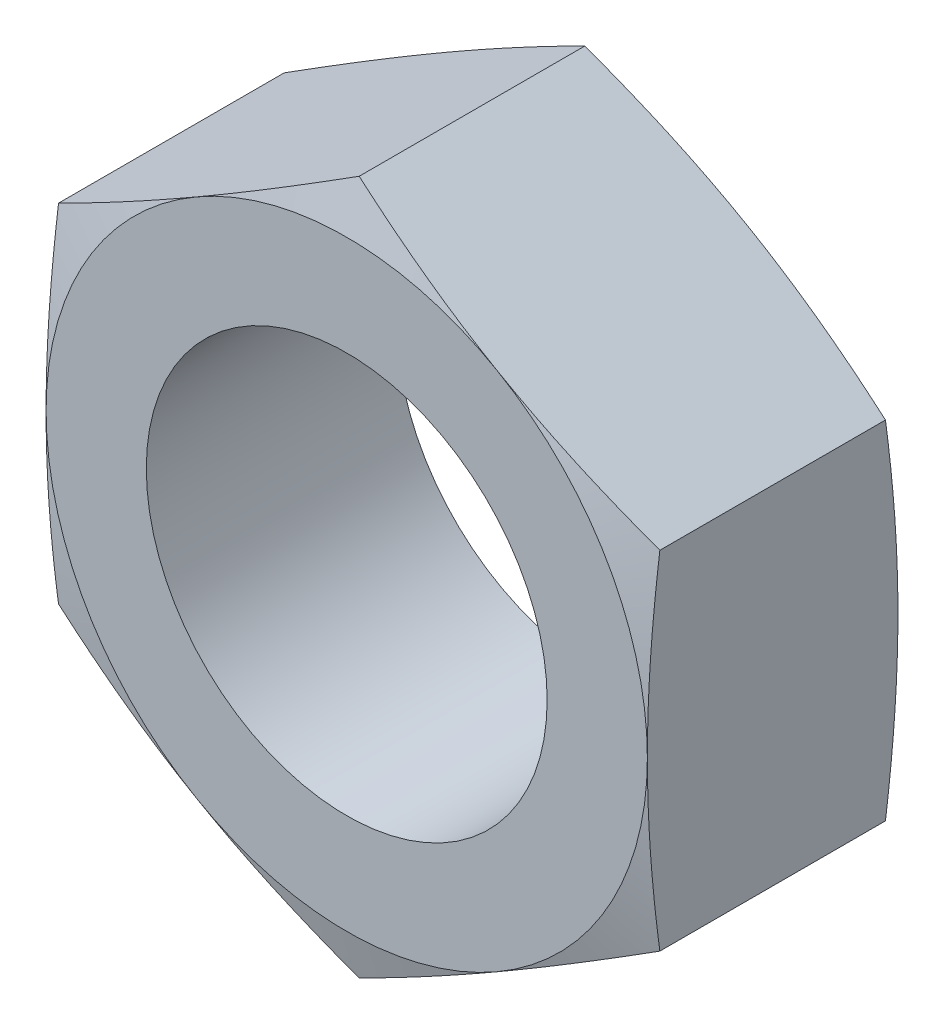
ISO-10303-21;
HEADER;
FILE_DESCRIPTION(('STEP AP214'),'2;1');
FILE_NAME('part.step','',(''),(''),'','','');
FILE_SCHEMA(('AUTOMOTIVE_DESIGN { 1 0 10303 214 1 1 1 1 }'));
ENDSEC;
DATA;
#1=APPLICATION_CONTEXT('core data for automotive mechanical design processes');
#2=APPLICATION_PROTOCOL_DEFINITION('international standard','automotive_design',2000,#1);
#3=PRODUCT_CONTEXT('',#1,'mechanical');
#4=PRODUCT('Part','Part','',(#3));
#5=PRODUCT_RELATED_PRODUCT_CATEGORY('part','',(#4));
#6=PRODUCT_DEFINITION_FORMATION('','',#4);
#7=PRODUCT_DEFINITION_CONTEXT('part definition',#1,'design');
#8=PRODUCT_DEFINITION('design','',#6,#7);
#9=PRODUCT_DEFINITION_SHAPE('','',#8);
#10=(LENGTH_UNIT() NAMED_UNIT(*) SI_UNIT(.MILLI.,.METRE.));
#11=(NAMED_UNIT(*) PLANE_ANGLE_UNIT() SI_UNIT($,.RADIAN.));
#12=(NAMED_UNIT(*) SI_UNIT($,.STERADIAN.) SOLID_ANGLE_UNIT());
#13=UNCERTAINTY_MEASURE_WITH_UNIT(LENGTH_MEASURE(1.E-05),#10,'distance_accuracy_value','');
#14=(GEOMETRIC_REPRESENTATION_CONTEXT(3) GLOBAL_UNCERTAINTY_ASSIGNED_CONTEXT((#13)) GLOBAL_UNIT_ASSIGNED_CONTEXT((#10,
#11,#12)) REPRESENTATION_CONTEXT('',''));
#15=CARTESIAN_POINT('',(0.,0.,0.));
#16=DIRECTION('',(0.,0.,1.));
#17=DIRECTION('',(1.,0.,0.));
#18=AXIS2_PLACEMENT_3D('',#15,#16,#17);
#19=CARTESIAN_POINT('',(0.,0.,10.));
#20=DIRECTION('',(0.,0.,1.));
#21=DIRECTION('',(1.,0.,0.));
#22=AXIS2_PLACEMENT_3D('',#19,#20,#21);
#23=PLANE('',#22);
#24=CARTESIAN_POINT('',(0.,0.,10.));
#25=DIRECTION('',(0.,0.,1.));
#26=DIRECTION('',(1.,0.,0.));
#27=AXIS2_PLACEMENT_3D('',#24,#25,#26);
#28=CIRCLE('',#27,8.);
#29=CARTESIAN_POINT('',(8.,0.,10.));
#30=VERTEX_POINT('',#29);
#31=EDGE_CURVE('E237',#30,#30,#28,.T.);
#32=ORIENTED_EDGE('',*,*,#31,.F.);
#33=EDGE_LOOP('',(#32));
#34=FACE_BOUND('',#33,.T.);
#35=CARTESIAN_POINT('',(0.,0.,10.));
#36=DIRECTION('',(0.,0.,-1.));
#37=DIRECTION('',(-1.,0.,0.));
#38=AXIS2_PLACEMENT_3D('',#35,#36,#37);
#39=CIRCLE('',#38,12.);
#40=CARTESIAN_POINT('',(12.,0.,10.));
#41=VERTEX_POINT('',#40);
#42=CARTESIAN_POINT('',(6.,-10.3923048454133,10.));
#43=VERTEX_POINT('',#42);
#44=EDGE_CURVE('E311',#41,#43,#39,.T.);
#45=ORIENTED_EDGE('',*,*,#44,.F.);
#46=CARTESIAN_POINT('',(6.,10.3923048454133,10.));
#47=VERTEX_POINT('',#46);
#48=EDGE_CURVE('E305',#47,#41,#39,.T.);
#49=ORIENTED_EDGE('',*,*,#48,.F.);
#50=CARTESIAN_POINT('',(-6.,10.3923048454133,10.));
#51=VERTEX_POINT('',#50);
#52=EDGE_CURVE('E307',#51,#47,#39,.T.);
#53=ORIENTED_EDGE('',*,*,#52,.F.);
#54=CARTESIAN_POINT('',(-12.,0.,10.));
#55=VERTEX_POINT('',#54);
#56=EDGE_CURVE('E36',#55,#51,#39,.T.);
#57=ORIENTED_EDGE('',*,*,#56,.F.);
#58=CARTESIAN_POINT('',(-6.,-10.3923048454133,10.));
#59=VERTEX_POINT('',#58);
#60=EDGE_CURVE('E44',#59,#55,#39,.T.);
#61=ORIENTED_EDGE('',*,*,#60,.F.);
#62=EDGE_CURVE('E312',#43,#59,#39,.T.);
#63=ORIENTED_EDGE('',*,*,#62,.F.);
#64=EDGE_LOOP('',(#45,#49,#53,#57,#61,#63));
#65=FACE_BOUND('',#64,.T.);
#66=ADVANCED_FACE('F14',(#34,#65),#23,.T.);
#67=CARTESIAN_POINT('',(0.,0.,0.));
#68=DIRECTION('',(0.,0.,1.));
#69=DIRECTION('',(1.,0.,0.));
#70=AXIS2_PLACEMENT_3D('',#67,#68,#69);
#71=PLANE('',#70);
#72=CARTESIAN_POINT('',(0.,0.,0.));
#73=DIRECTION('',(0.,0.,1.));
#74=DIRECTION('',(1.,0.,0.));
#75=AXIS2_PLACEMENT_3D('',#72,#73,#74);
#76=CIRCLE('',#75,8.);
#77=CARTESIAN_POINT('',(8.,0.,0.));
#78=VERTEX_POINT('',#77);
#79=EDGE_CURVE('E241',#78,#78,#76,.T.);
#80=ORIENTED_EDGE('',*,*,#79,.T.);
#81=EDGE_LOOP('',(#80));
#82=FACE_BOUND('',#81,.T.);
#83=CARTESIAN_POINT('',(0.,0.,0.));
#84=DIRECTION('',(0.,0.,-1.));
#85=DIRECTION('',(-1.,0.,0.));
#86=AXIS2_PLACEMENT_3D('',#83,#84,#85);
#87=CIRCLE('',#86,12.);
#88=CARTESIAN_POINT('',(6.,10.3923048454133,0.));
#89=VERTEX_POINT('',#88);
#90=CARTESIAN_POINT('',(12.,0.,0.));
#91=VERTEX_POINT('',#90);
#92=EDGE_CURVE('E277',#89,#91,#87,.T.);
#93=ORIENTED_EDGE('',*,*,#92,.T.);
#94=CARTESIAN_POINT('',(6.,-10.3923048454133,0.));
#95=VERTEX_POINT('',#94);
#96=EDGE_CURVE('E146',#91,#95,#87,.T.);
#97=ORIENTED_EDGE('',*,*,#96,.T.);
#98=CARTESIAN_POINT('',(-6.,-10.3923048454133,0.));
#99=VERTEX_POINT('',#98);
#100=EDGE_CURVE('E145',#95,#99,#87,.T.);
#101=ORIENTED_EDGE('',*,*,#100,.T.);
#102=CARTESIAN_POINT('',(-12.,0.,0.));
#103=VERTEX_POINT('',#102);
#104=EDGE_CURVE('E124',#99,#103,#87,.T.);
#105=ORIENTED_EDGE('',*,*,#104,.T.);
#106=CARTESIAN_POINT('',(-6.,10.3923048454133,0.));
#107=VERTEX_POINT('',#106);
#108=EDGE_CURVE('E111',#103,#107,#87,.T.);
#109=ORIENTED_EDGE('',*,*,#108,.T.);
#110=EDGE_CURVE('E122',#107,#89,#87,.T.);
#111=ORIENTED_EDGE('',*,*,#110,.T.);
#112=EDGE_LOOP('',(#93,#97,#101,#105,#109,#111));
#113=FACE_BOUND('',#112,.T.);
#114=ADVANCED_FACE('F143',(#82,#113),#71,.F.);
#115=CARTESIAN_POINT('',(0.,0.,10.));
#116=DIRECTION('',(0.,0.,-1.));
#117=DIRECTION('',(-1.,0.,0.));
#118=AXIS2_PLACEMENT_3D('',#115,#116,#117);
#119=CYLINDRICAL_SURFACE('',#118,8.);
#120=ORIENTED_EDGE('',*,*,#31,.T.);
#121=EDGE_LOOP('',(#120));
#122=FACE_BOUND('',#121,.T.);
#123=ORIENTED_EDGE('',*,*,#79,.F.);
#124=EDGE_LOOP('',(#123));
#125=FACE_BOUND('',#124,.T.);
#126=ADVANCED_FACE('F172',(#122,#125),#119,.F.);
#127=CARTESIAN_POINT('',(0.,0.,1.30075128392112));
#128=DIRECTION('',(0.,0.,1.));
#129=DIRECTION('',(1.,0.,0.));
#130=AXIS2_PLACEMENT_3D('',#127,#128,#129);
#131=CONICAL_SURFACE('',#130,16.8544698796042,1.30899693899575);
#132=CARTESIAN_POINT('',(12.,-18.3750842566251,2.66512525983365));
#133=CARTESIAN_POINT('',(12.,-17.8301342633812,2.5429004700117));
#134=CARTESIAN_POINT('',(12.,-17.2848447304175,2.42216258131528));
#135=CARTESIAN_POINT('',(12.,-16.193419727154,2.18446328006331));
#136=CARTESIAN_POINT('',(12.,-15.6472842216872,2.06750202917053));
#137=CARTESIAN_POINT('',(12.,-14.5535179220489,1.83805828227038));
#138=CARTESIAN_POINT('',(12.,-14.0058861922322,1.72558023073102));
#139=CARTESIAN_POINT('',(12.,-12.9094863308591,1.50630937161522));
#140=CARTESIAN_POINT('',(12.,-12.3607182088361,1.39951651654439));
#141=CARTESIAN_POINT('',(12.,-11.2662261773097,1.19379445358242));
#142=CARTESIAN_POINT('',(12.,-10.7205128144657,1.09480940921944));
#143=CARTESIAN_POINT('',(12.,-9.62758625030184,0.905426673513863));
#144=CARTESIAN_POINT('',(12.,-9.08037304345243,0.815029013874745));
#145=CARTESIAN_POINT('',(12.,-7.98435571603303,0.644850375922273));
#146=CARTESIAN_POINT('',(12.,-7.43555180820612,0.565068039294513));
#147=CARTESIAN_POINT('',(12.,-6.33619606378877,0.418461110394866));
#148=CARTESIAN_POINT('',(12.,-5.785644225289,0.35163653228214));
#149=CARTESIAN_POINT('',(12.,-4.6765611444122,0.232826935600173));
#150=CARTESIAN_POINT('',(12.,-4.11801054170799,0.181019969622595));
#151=CARTESIAN_POINT('',(12.,-2.99949490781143,0.0958132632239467));
#152=CARTESIAN_POINT('',(12.,-2.43952990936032,0.0624131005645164));
#153=CARTESIAN_POINT('',(12.,-1.31899926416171,0.0159674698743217));
#154=CARTESIAN_POINT('',(12.,-0.758434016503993,0.00291256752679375));
#155=CARTESIAN_POINT('',(12.,0.362791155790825,-0.00203881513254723));
#156=CARTESIAN_POINT('',(12.,0.92345108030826,0.00606467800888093));
#157=CARTESIAN_POINT('',(12.,2.04612377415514,0.042974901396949));
#158=CARTESIAN_POINT('',(12.,2.60813401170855,0.0718570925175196));
#159=CARTESIAN_POINT('',(12.,3.73083907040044,0.148671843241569));
#160=CARTESIAN_POINT('',(12.,4.29153386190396,0.196604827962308));
#161=CARTESIAN_POINT('',(12.,5.41160234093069,0.309088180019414));
#162=CARTESIAN_POINT('',(12.,5.97097491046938,0.373649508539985));
#163=CARTESIAN_POINT('',(12.,7.08791795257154,0.5166885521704));
#164=CARTESIAN_POINT('',(12.,7.64548841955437,0.595166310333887));
#165=CARTESIAN_POINT('',(12.,8.7262421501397,0.758578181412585));
#166=CARTESIAN_POINT('',(12.,9.249524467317,0.842863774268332));
#167=CARTESIAN_POINT('',(12.,10.2946969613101,1.01970382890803));
#168=CARTESIAN_POINT('',(12.,10.8165870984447,1.11225852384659));
#169=CARTESIAN_POINT('',(12.,11.8591756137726,1.30411496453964));
#170=CARTESIAN_POINT('',(12.,12.3798738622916,1.40341741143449));
#171=CARTESIAN_POINT('',(12.,13.4201836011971,1.60751548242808));
#172=CARTESIAN_POINT('',(12.,13.9397951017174,1.71231105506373));
#173=CARTESIAN_POINT('',(12.,14.9782183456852,1.92642151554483));
#174=CARTESIAN_POINT('',(12.,15.4970298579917,2.03573752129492));
#175=CARTESIAN_POINT('',(12.,16.5338600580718,2.2580722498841));
#176=CARTESIAN_POINT('',(12.,17.0518787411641,2.37109099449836));
#177=CARTESIAN_POINT('',(12.,18.6048525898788,2.71469433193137));
#178=CARTESIAN_POINT('',(12.,19.6387979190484,2.94984114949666));
#179=CARTESIAN_POINT('',(12.,21.6944963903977,3.42623171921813));
#180=CARTESIAN_POINT('',(12.,22.7162689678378,3.66739215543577));
#181=CARTESIAN_POINT('',(12.,24.7583939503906,4.15572601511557));
#182=CARTESIAN_POINT('',(12.,25.7787463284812,4.40289955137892));
#183=CARTESIAN_POINT('',(12.,27.8170752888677,4.90137714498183));
#184=CARTESIAN_POINT('',(12.,28.8350532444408,5.15267559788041));
#185=CARTESIAN_POINT('',(12.,30.361374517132,5.53214451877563));
#186=CARTESIAN_POINT('',(12.,30.8700323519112,5.6590522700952));
#187=CARTESIAN_POINT('',(12.,31.8871612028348,5.91361202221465));
#188=CARTESIAN_POINT('',(12.,32.3956322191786,6.04126402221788));
#189=CARTESIAN_POINT('',(12.,32.9040217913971,6.16923953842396));
#190=B_SPLINE_CURVE_WITH_KNOTS('',3,(#132,#133,#134,#135,#136,#137,#138,#139,#140,#141,#142,
#143,#144,#145,#146,#147,#148,#149,#150,#151,#152,#153,#154,#155,#156,#157,#158,#159,#160,#161,
#162,#163,#164,#165,#166,#167,#168,#169,#170,#171,#172,#173,#174,#175,#176,#177,#178,#179,#180,
#181,#182,#183,#184,#185,#186,#187,#188,#189),.UNSPECIFIED.,.F.,.F.,(4,2,2,2,2,2,2,2,2,2,2,2,2,
2,2,2,2,2,2,2,2,2,2,2,2,2,2,2,4),(0.,1.6754722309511,3.35101608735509,5.0281816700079,
6.70533323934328,8.36913239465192,10.0329376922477,11.6965298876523,13.3601239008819,
15.0427029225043,16.7252433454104,18.4070033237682,20.0887611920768,21.7766576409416,
23.4645917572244,25.153641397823,26.8426962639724,28.4326982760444,30.0227451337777,
31.6129574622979,33.2031548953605,34.7937479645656,36.3843503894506,39.565333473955,
42.7148515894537,45.86442883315,49.0100325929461,50.5827830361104,52.1555317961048),.UNSPECIFIED.);
#191=CARTESIAN_POINT('',(12.,6.92820323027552,0.497422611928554));
#192=VERTEX_POINT('',#191);
#193=EDGE_CURVE('E180',#91,#192,#190,.T.);
#194=ORIENTED_EDGE('',*,*,#193,.F.);
#195=ORIENTED_EDGE('',*,*,#92,.F.);
#196=CARTESIAN_POINT('',(12.0002,6.92808776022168,0.497453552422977));
#197=CARTESIAN_POINT('',(11.5018535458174,7.2158082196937,0.42032798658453));
#198=CARTESIAN_POINT('',(11.0026035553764,7.50405033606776,0.350310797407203));
#199=CARTESIAN_POINT('',(10.0023405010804,8.08155247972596,0.227297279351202));
#200=CARTESIAN_POINT('',(9.50132680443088,8.37081287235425,0.174307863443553));
#201=CARTESIAN_POINT('',(8.50057386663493,8.94859785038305,0.0884432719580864));
#202=CARTESIAN_POINT('',(8.00084139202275,9.2371185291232,0.0554657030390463));
#203=CARTESIAN_POINT('',(7.00073918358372,9.81452780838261,0.0112461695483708));
#204=CARTESIAN_POINT('',(6.50036959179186,10.1034163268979,0.));
#205=CARTESIAN_POINT('',(5.49963040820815,10.6811933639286,0.));
#206=CARTESIAN_POINT('',(4.99926081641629,10.9700818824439,0.0112461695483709));
#207=CARTESIAN_POINT('',(3.99915860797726,11.5474911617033,0.0554657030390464));
#208=CARTESIAN_POINT('',(3.49942613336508,11.8360118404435,0.0884432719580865));
#209=CARTESIAN_POINT('',(2.49867319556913,12.4137968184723,0.174307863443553));
#210=CARTESIAN_POINT('',(1.99765949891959,12.7030572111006,0.227297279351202));
#211=CARTESIAN_POINT('',(0.997396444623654,13.2805593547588,0.350310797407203));
#212=CARTESIAN_POINT('',(0.498146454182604,13.5688014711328,0.420327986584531));
#213=CARTESIAN_POINT('',(-0.000199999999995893,13.8565219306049,0.497453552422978));
#214=B_SPLINE_CURVE_WITH_KNOTS('',3,(#196,#197,#198,#199,#200,#201,#202,#203,#204,#205,#206,
#207,#208,#209,#210,#211,#212,#213),.UNSPECIFIED.,.F.,.F.,(4,2,2,2,2,2,2,2,4),(0.,
1.74185054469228,3.48440735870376,5.21797126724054,6.95119970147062,8.68442813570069,
10.4179920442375,12.160548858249,13.9023994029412),.UNSPECIFIED.);
#215=EDGE_CURVE('E280',#192,#89,#214,.T.);
#216=ORIENTED_EDGE('',*,*,#215,.F.);
#217=EDGE_LOOP('',(#194,#195,#216));
#218=FACE_BOUND('',#217,.T.);
#219=ADVANCED_FACE('F167',(#218),#131,.T.);
#220=ORIENTED_EDGE('',*,*,#96,.F.);
#221=CARTESIAN_POINT('',(12.,-6.92820323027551,0.497422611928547));
#222=VERTEX_POINT('',#221);
#223=EDGE_CURVE('E258',#222,#91,#190,.T.);
#224=ORIENTED_EDGE('',*,*,#223,.F.);
#225=CARTESIAN_POINT('',(-0.000200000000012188,-13.8565219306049,0.497453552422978));
#226=CARTESIAN_POINT('',(0.498146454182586,-13.5688014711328,0.420327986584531));
#227=CARTESIAN_POINT('',(0.997396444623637,-13.2805593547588,0.350310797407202));
#228=CARTESIAN_POINT('',(1.99765949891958,-12.7030572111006,0.2272972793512));
#229=CARTESIAN_POINT('',(2.49867319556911,-12.4137968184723,0.17430786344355));
#230=CARTESIAN_POINT('',(3.49942613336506,-11.8360118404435,0.0884432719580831));
#231=CARTESIAN_POINT('',(3.99915860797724,-11.5474911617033,0.0554657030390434));
#232=CARTESIAN_POINT('',(4.99926081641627,-10.9700818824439,0.0112461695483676));
#233=CARTESIAN_POINT('',(5.49963040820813,-10.6811933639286,0.));
#234=CARTESIAN_POINT('',(6.50036959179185,-10.1034163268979,0.));
#235=CARTESIAN_POINT('',(7.00073918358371,-9.8145278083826,0.0112461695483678));
#236=CARTESIAN_POINT('',(8.00084139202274,-9.23711852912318,0.0554657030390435));
#237=CARTESIAN_POINT('',(8.50057386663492,-8.94859785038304,0.0884432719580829));
#238=CARTESIAN_POINT('',(9.50132680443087,-8.37081287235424,0.174307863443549));
#239=CARTESIAN_POINT('',(10.0023405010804,-8.08155247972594,0.227297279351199));
#240=CARTESIAN_POINT('',(11.0026035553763,-7.50405033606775,0.3503107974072));
#241=CARTESIAN_POINT('',(11.5018535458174,-7.21580821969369,0.420327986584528));
#242=CARTESIAN_POINT('',(12.0002,-6.92808776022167,0.497453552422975));
#243=B_SPLINE_CURVE_WITH_KNOTS('',3,(#225,#226,#227,#228,#229,#230,#231,#232,#233,#234,#235,
#236,#237,#238,#239,#240,#241,#242),.UNSPECIFIED.,.F.,.F.,(4,2,2,2,2,2,2,2,4),(0.,
1.74185054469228,3.48440735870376,5.21797126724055,6.95119970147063,8.6844281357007,
10.4179920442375,12.160548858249,13.9023994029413),.UNSPECIFIED.);
#244=EDGE_CURVE('E149',#95,#222,#243,.T.);
#245=ORIENTED_EDGE('',*,*,#244,.F.);
#246=EDGE_LOOP('',(#220,#224,#245));
#247=FACE_BOUND('',#246,.T.);
#248=ADVANCED_FACE('F171',(#247),#131,.T.);
#249=CARTESIAN_POINT('',(0.,0.,10.));
#250=DIRECTION('',(0.,0.,-1.));
#251=DIRECTION('',(-1.,0.,0.));
#252=AXIS2_PLACEMENT_3D('',#249,#250,#251);
#253=CONICAL_SURFACE('',#252,12.,1.30899693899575);
#254=CARTESIAN_POINT('',(12.,-18.3750842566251,7.33487474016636));
#255=CARTESIAN_POINT('',(12.,-17.8301342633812,7.4570995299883));
#256=CARTESIAN_POINT('',(12.,-17.2848447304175,7.57783741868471));
#257=CARTESIAN_POINT('',(12.,-16.193419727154,7.81553671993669));
#258=CARTESIAN_POINT('',(12.,-15.6472842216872,7.93249797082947));
#259=CARTESIAN_POINT('',(12.,-14.5535179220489,8.16194171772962));
#260=CARTESIAN_POINT('',(12.,-14.0058861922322,8.27441976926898));
#261=CARTESIAN_POINT('',(12.,-12.9094863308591,8.49369062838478));
#262=CARTESIAN_POINT('',(12.,-12.3607182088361,8.60048348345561));
#263=CARTESIAN_POINT('',(12.,-11.2662261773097,8.80620554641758));
#264=CARTESIAN_POINT('',(12.,-10.7205128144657,8.90519059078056));
#265=CARTESIAN_POINT('',(12.,-9.62758625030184,9.09457332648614));
#266=CARTESIAN_POINT('',(12.,-9.08037304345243,9.18497098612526));
#267=CARTESIAN_POINT('',(12.,-7.98435571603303,9.35514962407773));
#268=CARTESIAN_POINT('',(12.,-7.43555180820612,9.43493196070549));
#269=CARTESIAN_POINT('',(12.,-6.33619606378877,9.58153888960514));
#270=CARTESIAN_POINT('',(12.,-5.785644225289,9.64836346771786));
#271=CARTESIAN_POINT('',(12.,-4.6765611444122,9.76717306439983));
#272=CARTESIAN_POINT('',(12.,-4.11801054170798,9.81898003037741));
#273=CARTESIAN_POINT('',(12.,-2.99949490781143,9.90418673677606));
#274=CARTESIAN_POINT('',(12.,-2.43952990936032,9.93758689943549));
#275=CARTESIAN_POINT('',(12.,-1.3189992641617,9.98403253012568));
#276=CARTESIAN_POINT('',(12.,-0.758434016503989,9.99708743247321));
#277=CARTESIAN_POINT('',(12.,0.36279115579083,10.0020388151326));
#278=CARTESIAN_POINT('',(12.,0.923451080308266,9.99393532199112));
#279=CARTESIAN_POINT('',(12.,2.04612377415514,9.95702509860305));
#280=CARTESIAN_POINT('',(12.,2.60813401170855,9.92814290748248));
#281=CARTESIAN_POINT('',(12.,3.73083907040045,9.85132815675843));
#282=CARTESIAN_POINT('',(12.,4.29153386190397,9.80339517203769));
#283=CARTESIAN_POINT('',(12.,5.4116023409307,9.69091181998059));
#284=CARTESIAN_POINT('',(12.,5.97097491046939,9.62635049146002));
#285=CARTESIAN_POINT('',(12.,7.08791795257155,9.4833114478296));
#286=CARTESIAN_POINT('',(12.,7.64548841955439,9.40483368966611));
#287=CARTESIAN_POINT('',(12.,8.72624215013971,9.24142181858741));
#288=CARTESIAN_POINT('',(12.,9.24952446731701,9.15713622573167));
#289=CARTESIAN_POINT('',(12.,10.2946969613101,8.98029617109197));
#290=CARTESIAN_POINT('',(12.,10.8165870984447,8.88774147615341));
#291=CARTESIAN_POINT('',(12.,11.8591756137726,8.69588503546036));
#292=CARTESIAN_POINT('',(12.,12.3798738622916,8.59658258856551));
#293=CARTESIAN_POINT('',(12.,13.4201836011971,8.39248451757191));
#294=CARTESIAN_POINT('',(12.,13.9397951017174,8.28768894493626));
#295=CARTESIAN_POINT('',(12.,14.9782183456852,8.07357848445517));
#296=CARTESIAN_POINT('',(12.,15.4970298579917,7.96426247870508));
#297=CARTESIAN_POINT('',(12.,16.5338600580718,7.7419277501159));
#298=CARTESIAN_POINT('',(12.,17.0518787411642,7.62890900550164));
#299=CARTESIAN_POINT('',(12.,18.6048525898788,7.28530566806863));
#300=CARTESIAN_POINT('',(12.,19.6387979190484,7.05015885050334));
#301=CARTESIAN_POINT('',(12.,21.6944963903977,6.57376828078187));
#302=CARTESIAN_POINT('',(12.,22.7162689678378,6.33260784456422));
#303=CARTESIAN_POINT('',(12.,24.7583939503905,5.84427398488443));
#304=CARTESIAN_POINT('',(12.,25.7787463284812,5.59710044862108));
#305=CARTESIAN_POINT('',(12.,27.8170752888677,5.09862285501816));
#306=CARTESIAN_POINT('',(12.,28.8350532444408,4.84732440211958));
#307=CARTESIAN_POINT('',(12.,30.361374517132,4.46785548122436));
#308=CARTESIAN_POINT('',(12.,30.8700323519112,4.34094772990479));
#309=CARTESIAN_POINT('',(12.,31.8871612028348,4.08638797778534));
#310=CARTESIAN_POINT('',(12.,32.3956322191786,3.95873597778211));
#311=CARTESIAN_POINT('',(12.,32.9040217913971,3.83076046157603));
#312=B_SPLINE_CURVE_WITH_KNOTS('',3,(#254,#255,#256,#257,#258,#259,#260,#261,#262,#263,#264,
#265,#266,#267,#268,#269,#270,#271,#272,#273,#274,#275,#276,#277,#278,#279,#280,#281,#282,#283,
#284,#285,#286,#287,#288,#289,#290,#291,#292,#293,#294,#295,#296,#297,#298,#299,#300,#301,#302,
#303,#304,#305,#306,#307,#308,#309,#310,#311),.UNSPECIFIED.,.F.,.F.,(4,2,2,2,2,2,2,2,2,2,2,2,2,
2,2,2,2,2,2,2,2,2,2,2,2,2,2,2,4),(0.,1.6754722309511,3.35101608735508,5.0281816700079,
6.70533323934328,8.36913239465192,10.0329376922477,11.6965298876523,13.3601239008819,
15.0427029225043,16.7252433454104,18.4070033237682,20.0887611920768,21.7766576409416,
23.4645917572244,25.153641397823,26.8426962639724,28.4326982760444,30.0227451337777,
31.6129574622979,33.2031548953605,34.7937479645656,36.3843503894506,39.565333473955,
42.7148515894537,45.86442883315,49.0100325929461,50.5827830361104,52.1555317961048),.UNSPECIFIED.);
#313=CARTESIAN_POINT('',(12.,-6.9282032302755,9.50257738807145));
#314=VERTEX_POINT('',#313);
#315=EDGE_CURVE('E19',#41,#314,#312,.F.);
#316=ORIENTED_EDGE('',*,*,#315,.F.);
#317=ORIENTED_EDGE('',*,*,#44,.T.);
#318=CARTESIAN_POINT('',(12.0002,-6.92808776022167,9.50254644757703));
#319=CARTESIAN_POINT('',(11.5018535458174,-7.21580821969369,9.57967201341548));
#320=CARTESIAN_POINT('',(11.0026035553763,-7.50405033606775,9.6496892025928));
#321=CARTESIAN_POINT('',(10.0023405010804,-8.08155247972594,9.7727027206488));
#322=CARTESIAN_POINT('',(9.50132680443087,-8.37081287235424,9.82569213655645));
#323=CARTESIAN_POINT('',(8.50057386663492,-8.94859785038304,9.91155672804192));
#324=CARTESIAN_POINT('',(8.00084139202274,-9.23711852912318,9.94453429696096));
#325=CARTESIAN_POINT('',(7.00073918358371,-9.8145278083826,9.98875383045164));
#326=CARTESIAN_POINT('',(6.50036959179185,-10.1034163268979,10.));
#327=CARTESIAN_POINT('',(5.49963040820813,-10.6811933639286,10.));
#328=CARTESIAN_POINT('',(4.99926081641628,-10.9700818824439,9.98875383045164));
#329=CARTESIAN_POINT('',(3.99915860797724,-11.5474911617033,9.94453429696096));
#330=CARTESIAN_POINT('',(3.49942613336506,-11.8360118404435,9.91155672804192));
#331=CARTESIAN_POINT('',(2.49867319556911,-12.4137968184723,9.82569213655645));
#332=CARTESIAN_POINT('',(1.99765949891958,-12.7030572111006,9.7727027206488));
#333=CARTESIAN_POINT('',(0.997396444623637,-13.2805593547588,9.6496892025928));
#334=CARTESIAN_POINT('',(0.498146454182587,-13.5688014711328,9.57967201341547));
#335=CARTESIAN_POINT('',(-0.000200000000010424,-13.8565219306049,9.50254644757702));
#336=B_SPLINE_CURVE_WITH_KNOTS('',3,(#318,#319,#320,#321,#322,#323,#324,#325,#326,#327,#328,
#329,#330,#331,#332,#333,#334,#335),.UNSPECIFIED.,.F.,.F.,(4,2,2,2,2,2,2,2,4),(0.,
1.74185054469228,3.48440735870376,5.21797126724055,6.95119970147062,8.6844281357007,
10.4179920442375,12.160548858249,13.9023994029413),.UNSPECIFIED.);
#337=EDGE_CURVE('E271',#314,#43,#336,.T.);
#338=ORIENTED_EDGE('',*,*,#337,.F.);
#339=EDGE_LOOP('',(#316,#317,#338));
#340=FACE_BOUND('',#339,.T.);
#341=ADVANCED_FACE('F329',(#340),#253,.T.);
#342=ORIENTED_EDGE('',*,*,#48,.T.);
#343=CARTESIAN_POINT('',(12.,6.92820323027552,9.50257738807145));
#344=VERTEX_POINT('',#343);
#345=EDGE_CURVE('E9',#344,#41,#312,.F.);
#346=ORIENTED_EDGE('',*,*,#345,.F.);
#347=CARTESIAN_POINT('',(-0.00019999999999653,13.8565219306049,9.50254644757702));
#348=CARTESIAN_POINT('',(0.498146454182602,13.5688014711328,9.57967201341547));
#349=CARTESIAN_POINT('',(0.997396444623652,13.2805593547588,9.6496892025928));
#350=CARTESIAN_POINT('',(1.99765949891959,12.7030572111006,9.7727027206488));
#351=CARTESIAN_POINT('',(2.49867319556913,12.4137968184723,9.82569213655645));
#352=CARTESIAN_POINT('',(3.49942613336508,11.8360118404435,9.91155672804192));
#353=CARTESIAN_POINT('',(3.99915860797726,11.5474911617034,9.94453429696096));
#354=CARTESIAN_POINT('',(4.99926081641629,10.9700818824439,9.98875383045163));
#355=CARTESIAN_POINT('',(5.49963040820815,10.6811933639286,10.));
#356=CARTESIAN_POINT('',(6.50036959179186,10.1034163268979,10.));
#357=CARTESIAN_POINT('',(7.00073918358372,9.81452780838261,9.98875383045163));
#358=CARTESIAN_POINT('',(8.00084139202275,9.2371185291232,9.94453429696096));
#359=CARTESIAN_POINT('',(8.50057386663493,8.94859785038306,9.91155672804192));
#360=CARTESIAN_POINT('',(9.50132680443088,8.37081287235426,9.82569213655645));
#361=CARTESIAN_POINT('',(10.0023405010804,8.08155247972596,9.7727027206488));
#362=CARTESIAN_POINT('',(11.0026035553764,7.50405033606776,9.6496892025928));
#363=CARTESIAN_POINT('',(11.5018535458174,7.2158082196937,9.57967201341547));
#364=CARTESIAN_POINT('',(12.0002,6.92808776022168,9.50254644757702));
#365=B_SPLINE_CURVE_WITH_KNOTS('',3,(#347,#348,#349,#350,#351,#352,#353,#354,#355,#356,#357,
#358,#359,#360,#361,#362,#363,#364),.UNSPECIFIED.,.F.,.F.,(4,2,2,2,2,2,2,2,4),(0.,
1.74185054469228,3.48440735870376,5.21797126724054,6.95119970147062,8.68442813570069,
10.4179920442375,12.1605488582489,13.9023994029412),.UNSPECIFIED.);
#366=EDGE_CURVE('E285',#47,#344,#365,.T.);
#367=ORIENTED_EDGE('',*,*,#366,.F.);
#368=EDGE_LOOP('',(#342,#346,#367));
#369=FACE_BOUND('',#368,.T.);
#370=ADVANCED_FACE('F303',(#369),#253,.T.);
#371=ORIENTED_EDGE('',*,*,#100,.F.);
#372=CARTESIAN_POINT('',(0.,-13.856406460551,0.497422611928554));
#373=VERTEX_POINT('',#372);
#374=EDGE_CURVE('E158',#373,#95,#243,.T.);
#375=ORIENTED_EDGE('',*,*,#374,.F.);
#376=CARTESIAN_POINT('',(-12.0002,-6.92808776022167,0.497453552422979));
#377=CARTESIAN_POINT('',(-11.5018535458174,-7.21580821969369,0.42032798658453));
#378=CARTESIAN_POINT('',(-11.0026035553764,-7.50405033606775,0.350310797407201));
#379=CARTESIAN_POINT('',(-10.0023405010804,-8.08155247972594,0.2272972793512));
#380=CARTESIAN_POINT('',(-9.50132680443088,-8.37081287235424,0.174307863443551));
#381=CARTESIAN_POINT('',(-8.50057386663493,-8.94859785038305,0.088443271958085));
#382=CARTESIAN_POINT('',(-8.00084139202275,-9.23711852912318,0.0554657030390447));
#383=CARTESIAN_POINT('',(-7.00073918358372,-9.8145278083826,0.0112461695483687));
#384=CARTESIAN_POINT('',(-6.50036959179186,-10.1034163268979,0.));
#385=CARTESIAN_POINT('',(-5.49963040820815,-10.6811933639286,0.));
#386=CARTESIAN_POINT('',(-4.99926081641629,-10.9700818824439,0.0112461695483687));
#387=CARTESIAN_POINT('',(-3.99915860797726,-11.5474911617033,0.0554657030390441));
#388=CARTESIAN_POINT('',(-3.49942613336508,-11.8360118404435,0.0884432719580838));
#389=CARTESIAN_POINT('',(-2.49867319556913,-12.4137968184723,0.17430786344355));
#390=CARTESIAN_POINT('',(-1.9976594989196,-12.7030572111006,0.227297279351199));
#391=CARTESIAN_POINT('',(-0.997396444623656,-13.2805593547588,0.3503107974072));
#392=CARTESIAN_POINT('',(-0.498146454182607,-13.5688014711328,0.420327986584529));
#393=CARTESIAN_POINT('',(0.000199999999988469,-13.8565219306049,0.497453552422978));
#394=B_SPLINE_CURVE_WITH_KNOTS('',3,(#376,#377,#378,#379,#380,#381,#382,#383,#384,#385,#386,
#387,#388,#389,#390,#391,#392,#393),.UNSPECIFIED.,.F.,.F.,(4,2,2,2,2,2,2,2,4),(0.,
1.74185054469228,3.48440735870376,5.21797126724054,6.95119970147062,8.68442813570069,
10.4179920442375,12.1605488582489,13.9023994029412),.UNSPECIFIED.);
#395=EDGE_CURVE('E159',#99,#373,#394,.T.);
#396=ORIENTED_EDGE('',*,*,#395,.F.);
#397=EDGE_LOOP('',(#371,#375,#396));
#398=FACE_BOUND('',#397,.T.);
#399=ADVANCED_FACE('F321',(#398),#131,.T.);
#400=CARTESIAN_POINT('',(0.,-13.856406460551,9.50257738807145));
#401=VERTEX_POINT('',#400);
#402=EDGE_CURVE('E286',#43,#401,#336,.T.);
#403=ORIENTED_EDGE('',*,*,#402,.F.);
#404=ORIENTED_EDGE('',*,*,#62,.T.);
#405=CARTESIAN_POINT('',(0.000199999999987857,-13.8565219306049,9.50254644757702));
#406=CARTESIAN_POINT('',(-0.498146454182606,-13.5688014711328,9.57967201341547));
#407=CARTESIAN_POINT('',(-0.997396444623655,-13.2805593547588,9.6496892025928));
#408=CARTESIAN_POINT('',(-1.99765949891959,-12.7030572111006,9.7727027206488));
#409=CARTESIAN_POINT('',(-2.49867319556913,-12.4137968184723,9.82569213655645));
#410=CARTESIAN_POINT('',(-3.49942613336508,-11.8360118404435,9.91155672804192));
#411=CARTESIAN_POINT('',(-3.99915860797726,-11.5474911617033,9.94453429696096));
#412=CARTESIAN_POINT('',(-4.99926081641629,-10.9700818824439,9.98875383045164));
#413=CARTESIAN_POINT('',(-5.49963040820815,-10.6811933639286,10.));
#414=CARTESIAN_POINT('',(-6.50036959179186,-10.1034163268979,10.));
#415=CARTESIAN_POINT('',(-7.00073918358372,-9.8145278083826,9.98875383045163));
#416=CARTESIAN_POINT('',(-8.00084139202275,-9.23711852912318,9.94453429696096));
#417=CARTESIAN_POINT('',(-8.50057386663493,-8.94859785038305,9.91155672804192));
#418=CARTESIAN_POINT('',(-9.50132680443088,-8.37081287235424,9.82569213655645));
#419=CARTESIAN_POINT('',(-10.0023405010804,-8.08155247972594,9.7727027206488));
#420=CARTESIAN_POINT('',(-11.0026035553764,-7.50405033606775,9.6496892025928));
#421=CARTESIAN_POINT('',(-11.5018535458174,-7.21580821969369,9.57967201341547));
#422=CARTESIAN_POINT('',(-12.0002,-6.92808776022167,9.50254644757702));
#423=B_SPLINE_CURVE_WITH_KNOTS('',3,(#405,#406,#407,#408,#409,#410,#411,#412,#413,#414,#415,
#416,#417,#418,#419,#420,#421,#422),.UNSPECIFIED.,.F.,.F.,(4,2,2,2,2,2,2,2,4),(0.,
1.74185054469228,3.48440735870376,5.21797126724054,6.95119970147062,8.68442813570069,
10.4179920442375,12.160548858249,13.9023994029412),.UNSPECIFIED.);
#424=EDGE_CURVE('E223',#401,#59,#423,.T.);
#425=ORIENTED_EDGE('',*,*,#424,.F.);
#426=EDGE_LOOP('',(#403,#404,#425));
#427=FACE_BOUND('',#426,.T.);
#428=ADVANCED_FACE('F314',(#427),#253,.T.);
#429=ORIENTED_EDGE('',*,*,#104,.F.);
#430=CARTESIAN_POINT('',(-12.,-6.92820323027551,0.497422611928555));
#431=VERTEX_POINT('',#430);
#432=EDGE_CURVE('E131',#431,#99,#394,.T.);
#433=ORIENTED_EDGE('',*,*,#432,.F.);
#434=CARTESIAN_POINT('',(-12.,-18.3750842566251,2.66512525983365));
#435=CARTESIAN_POINT('',(-12.,-17.8301342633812,2.5429004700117));
#436=CARTESIAN_POINT('',(-12.,-17.2848447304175,2.42216258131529));
#437=CARTESIAN_POINT('',(-12.,-16.193419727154,2.18446328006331));
#438=CARTESIAN_POINT('',(-12.,-15.6472842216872,2.06750202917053));
#439=CARTESIAN_POINT('',(-12.,-14.5535179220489,1.83805828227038));
#440=CARTESIAN_POINT('',(-12.,-14.0058861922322,1.72558023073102));
#441=CARTESIAN_POINT('',(-12.,-12.9094863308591,1.50630937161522));
#442=CARTESIAN_POINT('',(-12.,-12.3607182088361,1.39951651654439));
#443=CARTESIAN_POINT('',(-12.,-11.2662261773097,1.19379445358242));
#444=CARTESIAN_POINT('',(-12.,-10.7205128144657,1.09480940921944));
#445=CARTESIAN_POINT('',(-12.,-9.62758625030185,0.905426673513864));
#446=CARTESIAN_POINT('',(-12.,-9.08037304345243,0.815029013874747));
#447=CARTESIAN_POINT('',(-12.,-7.98435571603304,0.644850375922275));
#448=CARTESIAN_POINT('',(-12.,-7.43555180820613,0.565068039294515));
#449=CARTESIAN_POINT('',(-12.,-6.33619606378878,0.418461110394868));
#450=CARTESIAN_POINT('',(-12.,-5.78564422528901,0.351636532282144));
#451=CARTESIAN_POINT('',(-12.,-4.67656114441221,0.232826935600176));
#452=CARTESIAN_POINT('',(-12.,-4.11801054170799,0.181019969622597));
#453=CARTESIAN_POINT('',(-12.,-2.99949490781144,0.0958132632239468));
#454=CARTESIAN_POINT('',(-12.,-2.43952990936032,0.0624131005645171));
#455=CARTESIAN_POINT('',(-12.,-1.31899926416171,0.0159674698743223));
#456=CARTESIAN_POINT('',(-12.,-0.758434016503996,0.00291256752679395));
#457=CARTESIAN_POINT('',(-12.,0.362791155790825,-0.00203881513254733));
#458=CARTESIAN_POINT('',(-12.,0.92345108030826,0.00606467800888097));
#459=CARTESIAN_POINT('',(-12.,2.04612377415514,0.0429749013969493));
#460=CARTESIAN_POINT('',(-12.,2.60813401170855,0.0718570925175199));
#461=CARTESIAN_POINT('',(-12.,3.73083907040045,0.148671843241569));
#462=CARTESIAN_POINT('',(-12.,4.29153386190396,0.196604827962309));
#463=CARTESIAN_POINT('',(-12.,5.4116023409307,0.309088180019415));
#464=CARTESIAN_POINT('',(-12.,5.97097491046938,0.373649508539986));
#465=CARTESIAN_POINT('',(-12.,7.08791795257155,0.516688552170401));
#466=CARTESIAN_POINT('',(-12.,7.64548841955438,0.595166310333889));
#467=CARTESIAN_POINT('',(-12.,8.72624215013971,0.758578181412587));
#468=CARTESIAN_POINT('',(-12.,9.24952446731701,0.842863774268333));
#469=CARTESIAN_POINT('',(-12.,10.2946969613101,1.01970382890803));
#470=CARTESIAN_POINT('',(-12.,10.8165870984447,1.11225852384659));
#471=CARTESIAN_POINT('',(-12.,11.8591756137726,1.30411496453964));
#472=CARTESIAN_POINT('',(-12.,12.3798738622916,1.40341741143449));
#473=CARTESIAN_POINT('',(-12.,13.4201836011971,1.60751548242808));
#474=CARTESIAN_POINT('',(-12.,13.9397951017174,1.71231105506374));
#475=CARTESIAN_POINT('',(-12.,14.9782183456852,1.92642151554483));
#476=CARTESIAN_POINT('',(-12.,15.4970298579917,2.03573752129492));
#477=CARTESIAN_POINT('',(-12.,16.5338600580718,2.2580722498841));
#478=CARTESIAN_POINT('',(-12.,17.0518787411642,2.37109099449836));
#479=CARTESIAN_POINT('',(-12.,18.6048525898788,2.71469433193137));
#480=CARTESIAN_POINT('',(-12.,19.6387979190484,2.94984114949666));
#481=CARTESIAN_POINT('',(-12.,21.6944963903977,3.42623171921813));
#482=CARTESIAN_POINT('',(-12.,22.7162689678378,3.66739215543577));
#483=CARTESIAN_POINT('',(-12.,24.7583939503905,4.15572601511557));
#484=CARTESIAN_POINT('',(-12.,25.7787463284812,4.40289955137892));
#485=CARTESIAN_POINT('',(-12.,27.8170752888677,4.90137714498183));
#486=CARTESIAN_POINT('',(-12.,28.8350532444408,5.15267559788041));
#487=CARTESIAN_POINT('',(-12.,30.361374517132,5.53214451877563));
#488=CARTESIAN_POINT('',(-12.,30.8700323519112,5.6590522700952));
#489=CARTESIAN_POINT('',(-12.,31.8871612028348,5.91361202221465));
#490=CARTESIAN_POINT('',(-12.,32.3956322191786,6.04126402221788));
#491=CARTESIAN_POINT('',(-12.,32.9040217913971,6.16923953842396));
#492=B_SPLINE_CURVE_WITH_KNOTS('',3,(#434,#435,#436,#437,#438,#439,#440,#441,#442,#443,#444,
#445,#446,#447,#448,#449,#450,#451,#452,#453,#454,#455,#456,#457,#458,#459,#460,#461,#462,#463,
#464,#465,#466,#467,#468,#469,#470,#471,#472,#473,#474,#475,#476,#477,#478,#479,#480,#481,#482,
#483,#484,#485,#486,#487,#488,#489,#490,#491),.UNSPECIFIED.,.F.,.F.,(4,2,2,2,2,2,2,2,2,2,2,2,2,
2,2,2,2,2,2,2,2,2,2,2,2,2,2,2,4),(0.,1.6754722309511,3.35101608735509,5.0281816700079,
6.70533323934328,8.36913239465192,10.0329376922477,11.6965298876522,13.3601239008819,
15.0427029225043,16.7252433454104,18.4070033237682,20.0887611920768,21.7766576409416,
23.4645917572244,25.153641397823,26.8426962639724,28.4326982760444,30.0227451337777,
31.6129574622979,33.2031548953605,34.7937479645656,36.3843503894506,39.565333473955,
42.7148515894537,45.86442883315,49.0100325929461,50.5827830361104,52.1555317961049),.UNSPECIFIED.);
#493=EDGE_CURVE('E127',#103,#431,#492,.F.);
#494=ORIENTED_EDGE('',*,*,#493,.F.);
#495=EDGE_LOOP('',(#429,#433,#494));
#496=FACE_BOUND('',#495,.T.);
#497=ADVANCED_FACE('F128',(#496),#131,.T.);
#498=CARTESIAN_POINT('',(-12.,-6.92820323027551,9.50257738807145));
#499=VERTEX_POINT('',#498);
#500=EDGE_CURVE('E236',#59,#499,#423,.T.);
#501=ORIENTED_EDGE('',*,*,#500,.F.);
#502=ORIENTED_EDGE('',*,*,#60,.T.);
#503=CARTESIAN_POINT('',(-12.,-18.3750842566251,7.33487474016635));
#504=CARTESIAN_POINT('',(-12.,-17.8301342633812,7.4570995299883));
#505=CARTESIAN_POINT('',(-12.,-17.2848447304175,7.57783741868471));
#506=CARTESIAN_POINT('',(-12.,-16.193419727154,7.81553671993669));
#507=CARTESIAN_POINT('',(-12.,-15.6472842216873,7.93249797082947));
#508=CARTESIAN_POINT('',(-12.,-14.5535179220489,8.16194171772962));
#509=CARTESIAN_POINT('',(-12.,-14.0058861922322,8.27441976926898));
#510=CARTESIAN_POINT('',(-12.,-12.9094863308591,8.49369062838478));
#511=CARTESIAN_POINT('',(-12.,-12.3607182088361,8.60048348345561));
#512=CARTESIAN_POINT('',(-12.,-11.2662261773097,8.80620554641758));
#513=CARTESIAN_POINT('',(-12.,-10.7205128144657,8.90519059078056));
#514=CARTESIAN_POINT('',(-12.,-9.62758625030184,9.09457332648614));
#515=CARTESIAN_POINT('',(-12.,-9.08037304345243,9.18497098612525));
#516=CARTESIAN_POINT('',(-12.,-7.98435571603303,9.35514962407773));
#517=CARTESIAN_POINT('',(-12.,-7.43555180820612,9.43493196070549));
#518=CARTESIAN_POINT('',(-12.,-6.33619606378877,9.58153888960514));
#519=CARTESIAN_POINT('',(-12.,-5.785644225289,9.64836346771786));
#520=CARTESIAN_POINT('',(-12.,-4.6765611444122,9.76717306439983));
#521=CARTESIAN_POINT('',(-12.,-4.11801054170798,9.81898003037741));
#522=CARTESIAN_POINT('',(-12.,-2.99949490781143,9.90418673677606));
#523=CARTESIAN_POINT('',(-12.,-2.43952990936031,9.93758689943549));
#524=CARTESIAN_POINT('',(-12.,-1.3189992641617,9.98403253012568));
#525=CARTESIAN_POINT('',(-12.,-0.758434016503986,9.99708743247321));
#526=CARTESIAN_POINT('',(-12.,0.362791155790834,10.0020388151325));
#527=CARTESIAN_POINT('',(-12.,0.923451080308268,9.99393532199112));
#528=CARTESIAN_POINT('',(-12.,2.04612377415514,9.95702509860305));
#529=CARTESIAN_POINT('',(-12.,2.60813401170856,9.92814290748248));
#530=CARTESIAN_POINT('',(-12.,3.73083907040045,9.85132815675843));
#531=CARTESIAN_POINT('',(-12.,4.29153386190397,9.80339517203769));
#532=CARTESIAN_POINT('',(-12.,5.4116023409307,9.69091181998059));
#533=CARTESIAN_POINT('',(-12.,5.97097491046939,9.62635049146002));
#534=CARTESIAN_POINT('',(-12.,7.08791795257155,9.4833114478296));
#535=CARTESIAN_POINT('',(-12.,7.64548841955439,9.40483368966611));
#536=CARTESIAN_POINT('',(-12.,8.72624215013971,9.24142181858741));
#537=CARTESIAN_POINT('',(-12.,9.24952446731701,9.15713622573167));
#538=CARTESIAN_POINT('',(-12.,10.2946969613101,8.98029617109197));
#539=CARTESIAN_POINT('',(-12.,10.8165870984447,8.88774147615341));
#540=CARTESIAN_POINT('',(-12.,11.8591756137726,8.69588503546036));
#541=CARTESIAN_POINT('',(-12.,12.3798738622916,8.59658258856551));
#542=CARTESIAN_POINT('',(-12.,13.4201836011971,8.39248451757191));
#543=CARTESIAN_POINT('',(-12.,13.9397951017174,8.28768894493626));
#544=CARTESIAN_POINT('',(-12.,14.9782183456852,8.07357848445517));
#545=CARTESIAN_POINT('',(-12.,15.4970298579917,7.96426247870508));
#546=CARTESIAN_POINT('',(-12.,16.5338600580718,7.74192775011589));
#547=CARTESIAN_POINT('',(-12.,17.0518787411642,7.62890900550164));
#548=CARTESIAN_POINT('',(-12.,18.6048525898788,7.28530566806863));
#549=CARTESIAN_POINT('',(-12.,19.6387979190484,7.05015885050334));
#550=CARTESIAN_POINT('',(-12.,21.6944963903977,6.57376828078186));
#551=CARTESIAN_POINT('',(-12.,22.7162689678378,6.33260784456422));
#552=CARTESIAN_POINT('',(-12.,24.7583939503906,5.84427398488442));
#553=CARTESIAN_POINT('',(-12.,25.7787463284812,5.59710044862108));
#554=CARTESIAN_POINT('',(-12.,27.8170752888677,5.09862285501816));
#555=CARTESIAN_POINT('',(-12.,28.8350532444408,4.84732440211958));
#556=CARTESIAN_POINT('',(-12.,30.361374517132,4.46785548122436));
#557=CARTESIAN_POINT('',(-12.,30.8700323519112,4.34094772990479));
#558=CARTESIAN_POINT('',(-12.,31.8871612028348,4.08638797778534));
#559=CARTESIAN_POINT('',(-12.,32.3956322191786,3.95873597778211));
#560=CARTESIAN_POINT('',(-12.,32.9040217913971,3.83076046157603));
#561=B_SPLINE_CURVE_WITH_KNOTS('',3,(#503,#504,#505,#506,#507,#508,#509,#510,#511,#512,#513,
#514,#515,#516,#517,#518,#519,#520,#521,#522,#523,#524,#525,#526,#527,#528,#529,#530,#531,#532,
#533,#534,#535,#536,#537,#538,#539,#540,#541,#542,#543,#544,#545,#546,#547,#548,#549,#550,#551,
#552,#553,#554,#555,#556,#557,#558,#559,#560),.UNSPECIFIED.,.F.,.F.,(4,2,2,2,2,2,2,2,2,2,2,2,2,
2,2,2,2,2,2,2,2,2,2,2,2,2,2,2,4),(0.,1.6754722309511,3.35101608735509,5.0281816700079,
6.70533323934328,8.36913239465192,10.0329376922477,11.6965298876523,13.3601239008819,
15.0427029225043,16.7252433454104,18.4070033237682,20.0887611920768,21.7766576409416,
23.4645917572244,25.153641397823,26.8426962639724,28.4326982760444,30.0227451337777,
31.6129574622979,33.2031548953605,34.7937479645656,36.3843503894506,39.565333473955,
42.7148515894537,45.86442883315,49.0100325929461,50.5827830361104,52.1555317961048),.UNSPECIFIED.);
#562=EDGE_CURVE('E235',#499,#55,#561,.T.);
#563=ORIENTED_EDGE('',*,*,#562,.F.);
#564=EDGE_LOOP('',(#501,#502,#563));
#565=FACE_BOUND('',#564,.T.);
#566=ADVANCED_FACE('F175',(#565),#253,.T.);
#567=ORIENTED_EDGE('',*,*,#108,.F.);
#568=CARTESIAN_POINT('',(-12.,6.92820323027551,0.497422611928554));
#569=VERTEX_POINT('',#568);
#570=EDGE_CURVE('E115',#569,#103,#492,.F.);
#571=ORIENTED_EDGE('',*,*,#570,.F.);
#572=CARTESIAN_POINT('',(0.000200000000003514,13.8565219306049,0.497453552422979));
#573=CARTESIAN_POINT('',(-0.498146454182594,13.5688014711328,0.420327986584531));
#574=CARTESIAN_POINT('',(-0.997396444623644,13.2805593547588,0.350310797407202));
#575=CARTESIAN_POINT('',(-1.99765949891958,12.7030572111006,0.227297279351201));
#576=CARTESIAN_POINT('',(-2.49867319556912,12.4137968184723,0.174307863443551));
#577=CARTESIAN_POINT('',(-3.49942613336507,11.8360118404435,0.0884432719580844));
#578=CARTESIAN_POINT('',(-3.99915860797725,11.5474911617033,0.0554657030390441));
#579=CARTESIAN_POINT('',(-4.99926081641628,10.9700818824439,0.0112461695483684));
#580=CARTESIAN_POINT('',(-5.49963040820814,10.6811933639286,0.));
#581=CARTESIAN_POINT('',(-6.50036959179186,10.1034163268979,0.));
#582=CARTESIAN_POINT('',(-7.00073918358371,9.8145278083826,0.0112461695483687));
#583=CARTESIAN_POINT('',(-8.00084139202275,9.23711852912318,0.0554657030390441));
#584=CARTESIAN_POINT('',(-8.50057386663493,8.94859785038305,0.0884432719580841));
#585=CARTESIAN_POINT('',(-9.50132680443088,8.37081287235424,0.174307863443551));
#586=CARTESIAN_POINT('',(-10.0023405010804,8.08155247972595,0.2272972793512));
#587=CARTESIAN_POINT('',(-11.0026035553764,7.50405033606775,0.350310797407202));
#588=CARTESIAN_POINT('',(-11.5018535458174,7.21580821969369,0.42032798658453));
#589=CARTESIAN_POINT('',(-12.0002,6.92808776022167,0.497453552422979));
#590=B_SPLINE_CURVE_WITH_KNOTS('',3,(#572,#573,#574,#575,#576,#577,#578,#579,#580,#581,#582,
#583,#584,#585,#586,#587,#588,#589),.UNSPECIFIED.,.F.,.F.,(4,2,2,2,2,2,2,2,4),(0.,
1.74185054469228,3.48440735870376,5.21797126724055,6.95119970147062,8.6844281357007,
10.4179920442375,12.160548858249,13.9023994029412),.UNSPECIFIED.);
#591=EDGE_CURVE('E117',#107,#569,#590,.T.);
#592=ORIENTED_EDGE('',*,*,#591,.F.);
#593=EDGE_LOOP('',(#567,#571,#592));
#594=FACE_BOUND('',#593,.T.);
#595=ADVANCED_FACE('F113',(#594),#131,.T.);
#596=ORIENTED_EDGE('',*,*,#56,.T.);
#597=CARTESIAN_POINT('',(-12.0002,6.92808776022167,9.50254644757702));
#598=CARTESIAN_POINT('',(-11.5018535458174,7.21580821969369,9.57967201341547));
#599=CARTESIAN_POINT('',(-11.0026035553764,7.50405033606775,9.6496892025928));
#600=CARTESIAN_POINT('',(-10.0023405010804,8.08155247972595,9.7727027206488));
#601=CARTESIAN_POINT('',(-9.50132680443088,8.37081287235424,9.82569213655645));
#602=CARTESIAN_POINT('',(-8.50057386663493,8.94859785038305,9.91155672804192));
#603=CARTESIAN_POINT('',(-8.00084139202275,9.23711852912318,9.94453429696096));
#604=CARTESIAN_POINT('',(-7.00073918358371,9.8145278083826,9.98875383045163));
#605=CARTESIAN_POINT('',(-6.50036959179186,10.1034163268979,10.));
#606=CARTESIAN_POINT('',(-5.49963040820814,10.6811933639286,10.));
#607=CARTESIAN_POINT('',(-4.99926081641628,10.9700818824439,9.98875383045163));
#608=CARTESIAN_POINT('',(-3.99915860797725,11.5474911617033,9.94453429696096));
#609=CARTESIAN_POINT('',(-3.49942613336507,11.8360118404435,9.91155672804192));
#610=CARTESIAN_POINT('',(-2.49867319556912,12.4137968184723,9.82569213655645));
#611=CARTESIAN_POINT('',(-1.99765949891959,12.7030572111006,9.7727027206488));
#612=CARTESIAN_POINT('',(-0.997396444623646,13.2805593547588,9.6496892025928));
#613=CARTESIAN_POINT('',(-0.498146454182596,13.5688014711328,9.57967201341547));
#614=CARTESIAN_POINT('',(0.000200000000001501,13.8565219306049,9.50254644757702));
#615=B_SPLINE_CURVE_WITH_KNOTS('',3,(#597,#598,#599,#600,#601,#602,#603,#604,#605,#606,#607,
#608,#609,#610,#611,#612,#613,#614),.UNSPECIFIED.,.F.,.F.,(4,2,2,2,2,2,2,2,4),(0.,
1.74185054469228,3.48440735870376,5.21797126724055,6.95119970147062,8.6844281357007,
10.4179920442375,12.160548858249,13.9023994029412),.UNSPECIFIED.);
#616=CARTESIAN_POINT('',(-12.,6.92820323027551,9.50257738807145));
#617=VERTEX_POINT('',#616);
#618=EDGE_CURVE('E222',#617,#51,#615,.T.);
#619=ORIENTED_EDGE('',*,*,#618,.F.);
#620=EDGE_CURVE('E229',#55,#617,#561,.T.);
#621=ORIENTED_EDGE('',*,*,#620,.F.);
#622=EDGE_LOOP('',(#596,#619,#621));
#623=FACE_BOUND('',#622,.T.);
#624=ADVANCED_FACE('F349',(#623),#253,.T.);
#625=ORIENTED_EDGE('',*,*,#110,.F.);
#626=CARTESIAN_POINT('',(0.,13.856406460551,0.497422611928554));
#627=VERTEX_POINT('',#626);
#628=EDGE_CURVE('E200',#627,#107,#590,.T.);
#629=ORIENTED_EDGE('',*,*,#628,.F.);
#630=EDGE_CURVE('E201',#89,#627,#214,.T.);
#631=ORIENTED_EDGE('',*,*,#630,.F.);
#632=EDGE_LOOP('',(#625,#629,#631));
#633=FACE_BOUND('',#632,.T.);
#634=ADVANCED_FACE('F174',(#633),#131,.T.);
#635=ORIENTED_EDGE('',*,*,#52,.T.);
#636=CARTESIAN_POINT('',(0.,13.856406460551,9.50257738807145));
#637=VERTEX_POINT('',#636);
#638=EDGE_CURVE('E287',#637,#47,#365,.T.);
#639=ORIENTED_EDGE('',*,*,#638,.F.);
#640=EDGE_CURVE('E214',#51,#637,#615,.T.);
#641=ORIENTED_EDGE('',*,*,#640,.F.);
#642=EDGE_LOOP('',(#635,#639,#641));
#643=FACE_BOUND('',#642,.T.);
#644=ADVANCED_FACE('F308',(#643),#253,.T.);
#645=CARTESIAN_POINT('',(12.,-6.9282032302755,10.));
#646=DIRECTION('',(-1.,0.,0.));
#647=DIRECTION('',(0.,0.,1.));
#648=AXIS2_PLACEMENT_3D('',#645,#646,#647);
#649=PLANE('',#648);
#650=DIRECTION('',(0.,0.,-1.));
#651=VECTOR('',#650,1.);
#652=CARTESIAN_POINT('',(12.,6.92820323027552,10.));
#653=LINE('',#652,#651);
#654=EDGE_CURVE('E240',#344,#192,#653,.T.);
#655=ORIENTED_EDGE('',*,*,#654,.F.);
#656=ORIENTED_EDGE('',*,*,#345,.T.);
#657=ORIENTED_EDGE('',*,*,#315,.T.);
#658=DIRECTION('',(0.,0.,-1.));
#659=VECTOR('',#658,1.);
#660=CARTESIAN_POINT('',(12.,-6.9282032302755,10.));
#661=LINE('',#660,#659);
#662=EDGE_CURVE('E246',#314,#222,#661,.T.);
#663=ORIENTED_EDGE('',*,*,#662,.T.);
#664=ORIENTED_EDGE('',*,*,#223,.T.);
#665=ORIENTED_EDGE('',*,*,#193,.T.);
#666=EDGE_LOOP('',(#655,#656,#657,#663,#664,#665));
#667=FACE_BOUND('',#666,.T.);
#668=ADVANCED_FACE('F265',(#667),#649,.F.);
#669=CARTESIAN_POINT('',(0.,-13.856406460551,10.));
#670=DIRECTION('',(-0.5,0.866025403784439,0.));
#671=DIRECTION('',(-0.866025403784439,-0.5,0.));
#672=AXIS2_PLACEMENT_3D('',#669,#670,#671);
#673=PLANE('',#672);
#674=ORIENTED_EDGE('',*,*,#662,.F.);
#675=ORIENTED_EDGE('',*,*,#337,.T.);
#676=ORIENTED_EDGE('',*,*,#402,.T.);
#677=DIRECTION('',(0.,0.,-1.));
#678=VECTOR('',#677,1.);
#679=CARTESIAN_POINT('',(0.,-13.856406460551,10.));
#680=LINE('',#679,#678);
#681=EDGE_CURVE('E249',#401,#373,#680,.T.);
#682=ORIENTED_EDGE('',*,*,#681,.T.);
#683=ORIENTED_EDGE('',*,*,#374,.T.);
#684=ORIENTED_EDGE('',*,*,#244,.T.);
#685=EDGE_LOOP('',(#674,#675,#676,#682,#683,#684));
#686=FACE_BOUND('',#685,.T.);
#687=ADVANCED_FACE('F165',(#686),#673,.F.);
#688=CARTESIAN_POINT('',(-12.,-6.92820323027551,10.));
#689=DIRECTION('',(0.5,0.866025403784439,0.));
#690=DIRECTION('',(-0.866025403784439,0.5,0.));
#691=AXIS2_PLACEMENT_3D('',#688,#689,#690);
#692=PLANE('',#691);
#693=ORIENTED_EDGE('',*,*,#681,.F.);
#694=ORIENTED_EDGE('',*,*,#424,.T.);
#695=ORIENTED_EDGE('',*,*,#500,.T.);
#696=DIRECTION('',(0.,0.,-1.));
#697=VECTOR('',#696,1.);
#698=CARTESIAN_POINT('',(-12.,-6.92820323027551,10.));
#699=LINE('',#698,#697);
#700=EDGE_CURVE('E252',#499,#431,#699,.T.);
#701=ORIENTED_EDGE('',*,*,#700,.T.);
#702=ORIENTED_EDGE('',*,*,#432,.T.);
#703=ORIENTED_EDGE('',*,*,#395,.T.);
#704=EDGE_LOOP('',(#693,#694,#695,#701,#702,#703));
#705=FACE_BOUND('',#704,.T.);
#706=ADVANCED_FACE('F318',(#705),#692,.F.);
#707=CARTESIAN_POINT('',(-12.,6.92820323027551,10.));
#708=DIRECTION('',(1.,0.,0.));
#709=DIRECTION('',(0.,1.,0.));
#710=AXIS2_PLACEMENT_3D('',#707,#708,#709);
#711=PLANE('',#710);
#712=ORIENTED_EDGE('',*,*,#700,.F.);
#713=ORIENTED_EDGE('',*,*,#562,.T.);
#714=ORIENTED_EDGE('',*,*,#620,.T.);
#715=DIRECTION('',(0.,0.,-1.));
#716=VECTOR('',#715,1.);
#717=CARTESIAN_POINT('',(-12.,6.92820323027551,10.));
#718=LINE('',#717,#716);
#719=EDGE_CURVE('E140',#617,#569,#718,.T.);
#720=ORIENTED_EDGE('',*,*,#719,.T.);
#721=ORIENTED_EDGE('',*,*,#570,.T.);
#722=ORIENTED_EDGE('',*,*,#493,.T.);
#723=EDGE_LOOP('',(#712,#713,#714,#720,#721,#722));
#724=FACE_BOUND('',#723,.T.);
#725=ADVANCED_FACE('F137',(#724),#711,.F.);
#726=CARTESIAN_POINT('',(0.,13.856406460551,10.));
#727=DIRECTION('',(0.5,-0.866025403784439,0.));
#728=DIRECTION('',(0.866025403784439,0.5,0.));
#729=AXIS2_PLACEMENT_3D('',#726,#727,#728);
#730=PLANE('',#729);
#731=ORIENTED_EDGE('',*,*,#719,.F.);
#732=ORIENTED_EDGE('',*,*,#618,.T.);
#733=ORIENTED_EDGE('',*,*,#640,.T.);
#734=DIRECTION('',(0.,0.,-1.));
#735=VECTOR('',#734,1.);
#736=CARTESIAN_POINT('',(0.,13.856406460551,10.));
#737=LINE('',#736,#735);
#738=EDGE_CURVE('E254',#637,#627,#737,.T.);
#739=ORIENTED_EDGE('',*,*,#738,.T.);
#740=ORIENTED_EDGE('',*,*,#628,.T.);
#741=ORIENTED_EDGE('',*,*,#591,.T.);
#742=EDGE_LOOP('',(#731,#732,#733,#739,#740,#741));
#743=FACE_BOUND('',#742,.T.);
#744=ADVANCED_FACE('F207',(#743),#730,.F.);
#745=CARTESIAN_POINT('',(12.,6.92820323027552,10.));
#746=DIRECTION('',(-0.5,-0.866025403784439,0.));
#747=DIRECTION('',(0.866025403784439,-0.5,0.));
#748=AXIS2_PLACEMENT_3D('',#745,#746,#747);
#749=PLANE('',#748);
#750=ORIENTED_EDGE('',*,*,#738,.F.);
#751=ORIENTED_EDGE('',*,*,#638,.T.);
#752=ORIENTED_EDGE('',*,*,#366,.T.);
#753=ORIENTED_EDGE('',*,*,#654,.T.);
#754=ORIENTED_EDGE('',*,*,#215,.T.);
#755=ORIENTED_EDGE('',*,*,#630,.T.);
#756=EDGE_LOOP('',(#750,#751,#752,#753,#754,#755));
#757=FACE_BOUND('',#756,.T.);
#758=ADVANCED_FACE('F16',(#757),#749,.F.);
#759=CLOSED_SHELL('',(#66,#114,#126,#219,#248,#341,#370,#399,#428,#497,#566,#595,#624,#634,#644,
#668,#687,#706,#725,#744,#758));
#760=MANIFOLD_SOLID_BREP('B1',#759);
#761=ADVANCED_BREP_SHAPE_REPRESENTATION('',(#18,#760),#14);
#762=SHAPE_DEFINITION_REPRESENTATION(#9,#761);
ENDSEC;
END-ISO-10303-21;
